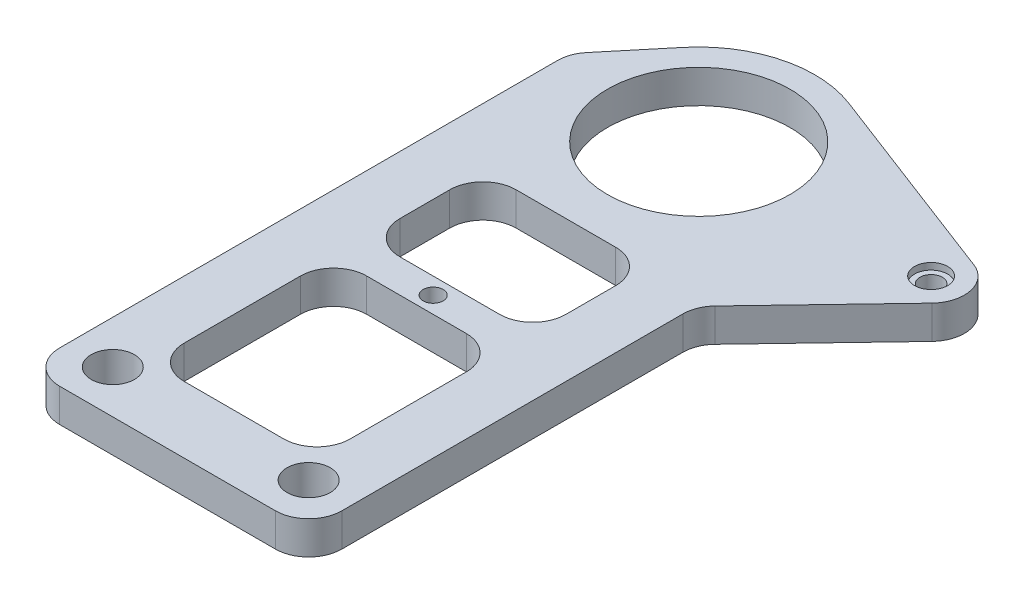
from build123d import *

# Parameters (mm, degrees)
ESQUISSE1_R             = 2.5
ESQUISSE1_R_2           = 27
ESQUISSE1_R_3           = 6.3
ESQUISSE1_R_4           = 2.9
BASE_EXTRUSION_DEPTH    = 10
ESQUISSE2_R             = 27.5
ESQUISSE2_R_2           = 3
ESQUISSE2_R_3           = 6.5
ENL_V_MAT_EXTRU_2_DEPTH = 180.164728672
ESQUISSE3_R             = 5
ENL_V_MAT_EXTRU_3_DEPTH = 2
ESQUISSE4_R             = 3.375
ENL_V_MAT_EXTRU_4_DEPTH = 180.164728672


with BuildPart() as part:
    # Esquisse1 → Base-Extrusion (new body)
    with BuildSketch(Plane(origin=(0, 0, 0), x_dir=(1, 0, 0), z_dir=(0, 1, 0))):
        with BuildLine():
            Line((-42.5, -150), (-42.5, 0))
            ThreePointArc((-42.5, 0), (-41.905399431, 3.396831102), (-40.192307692, 6.389710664))
            Line((-40.192307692, 6.389710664), (-26.923076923, 22.363987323))
            ThreePointArc((-26.923076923, 22.363987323), (-8.869719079, 33.857467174), (12.5, 32.691742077))
            Line((12.5, 32.691742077), (73.571428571, 9.340497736))
            ThreePointArc((73.571428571, 9.340497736), (79.755495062, 2.19779801), (77.231724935, -6.906674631))
            Line((77.231724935, -6.906674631), (45.268275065, -40.374427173))
            ThreePointArc((45.268275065, -40.374427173), (43.217832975, -43.560701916), (42.5, -47.281101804))
            Line((42.5, -47.281101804), (42.5, -150))
            ThreePointArc((42.5, -150), (39.571067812, -157.071067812), (32.5, -160))
            Line((32.5, -160), (-32.5, -160))
            ThreePointArc((-32.5, -160), (-39.571067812, -157.071067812), (-42.5, -150))
        make_face()
        with Locations((70, 0)):
            Circle(ESQUISSE1_R, mode=Mode.SUBTRACT)
        Circle(ESQUISSE1_R_2, mode=Mode.SUBTRACT)
        with Locations((29.5, -147)):
            Circle(ESQUISSE1_R_3, mode=Mode.SUBTRACT)
        with Locations((-29.5, -147)):
            Circle(ESQUISSE1_R_3, mode=Mode.SUBTRACT)
        with Locations((0, -80)):
            Circle(ESQUISSE1_R_4, mode=Mode.SUBTRACT)
        with BuildLine():
            Line((-15, -75), (15, -75))
            ThreePointArc((15, -75), (22.071067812, -72.071067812), (25, -65))
            Line((25, -65), (25, -50))
            ThreePointArc((25, -50), (22.071067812, -42.928932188), (15, -40))
            Line((15, -40), (-15, -40))
            ThreePointArc((-15, -40), (-22.071067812, -42.928932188), (-25, -50))
            Line((-25, -50), (-25, -65))
            ThreePointArc((-25, -65), (-22.071067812, -72.071067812), (-15, -75))
        make_face(mode=Mode.SUBTRACT)
        with BuildLine():
            Line((25, -130), (25, -95))
            ThreePointArc((25, -95), (22.071067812, -87.928932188), (15, -85))
            Line((15, -85), (-15, -85))
            ThreePointArc((-15, -85), (-22.071067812, -87.928932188), (-25, -95))
            Line((-25, -95), (-25, -130))
            ThreePointArc((-25, -130), (-22.071067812, -137.071067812), (-15, -140))
            Line((-15, -140), (15, -140))
            ThreePointArc((15, -140), (22.071067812, -137.071067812), (25, -130))
        make_face(mode=Mode.SUBTRACT)
    extrude(amount=BASE_EXTRUSION_DEPTH)

    # Esquisse2 → Enl_v. mat.-Extru.2 (cut, through all)
    with BuildSketch(Plane(origin=(0, 0, 0), x_dir=(1, 0, 0), z_dir=(0, 1, 0))):
        with Locations(Location((0, 0, 0), (0, 0, 270))):
            Circle(ESQUISSE2_R)
        with Locations(Location((0, -80, 0), (0, 0, 270))):
            Circle(ESQUISSE2_R_2)
        with Locations(Location((29.5, -147, 0), (0, 0, 270))):
            Circle(ESQUISSE2_R_3)
        with Locations(Location((-29.5, -147, 0), (0, 0, 270))):
            Circle(ESQUISSE2_R_3)
    extrude(amount=ENL_V_MAT_EXTRU_2_DEPTH, mode=Mode.SUBTRACT)

    # Esquisse3 → Enl_v. mat.-Extru.3 (cut)
    with BuildSketch(Plane(origin=(0, 10, 0), x_dir=(-1, 0, 0), z_dir=(0, 1, 0))):
        with Locations(Location((-70, 0, 0), (0, 0, 90))):
            Circle(ESQUISSE3_R)
    extrude(amount=-ENL_V_MAT_EXTRU_3_DEPTH, mode=Mode.SUBTRACT)

    # Esquisse4 → Enl_v. mat.-Extru.4 (cut, through all)
    with BuildSketch(Plane(origin=(0, 10, 0), x_dir=(-1, 0, 0), z_dir=(0, 1, 0))):
        with Locations(Location((-70, 0, 0), (0, 0, 90))):
            Circle(ESQUISSE4_R)
    extrude(amount=-ENL_V_MAT_EXTRU_4_DEPTH, mode=Mode.SUBTRACT)


solid = part.part
